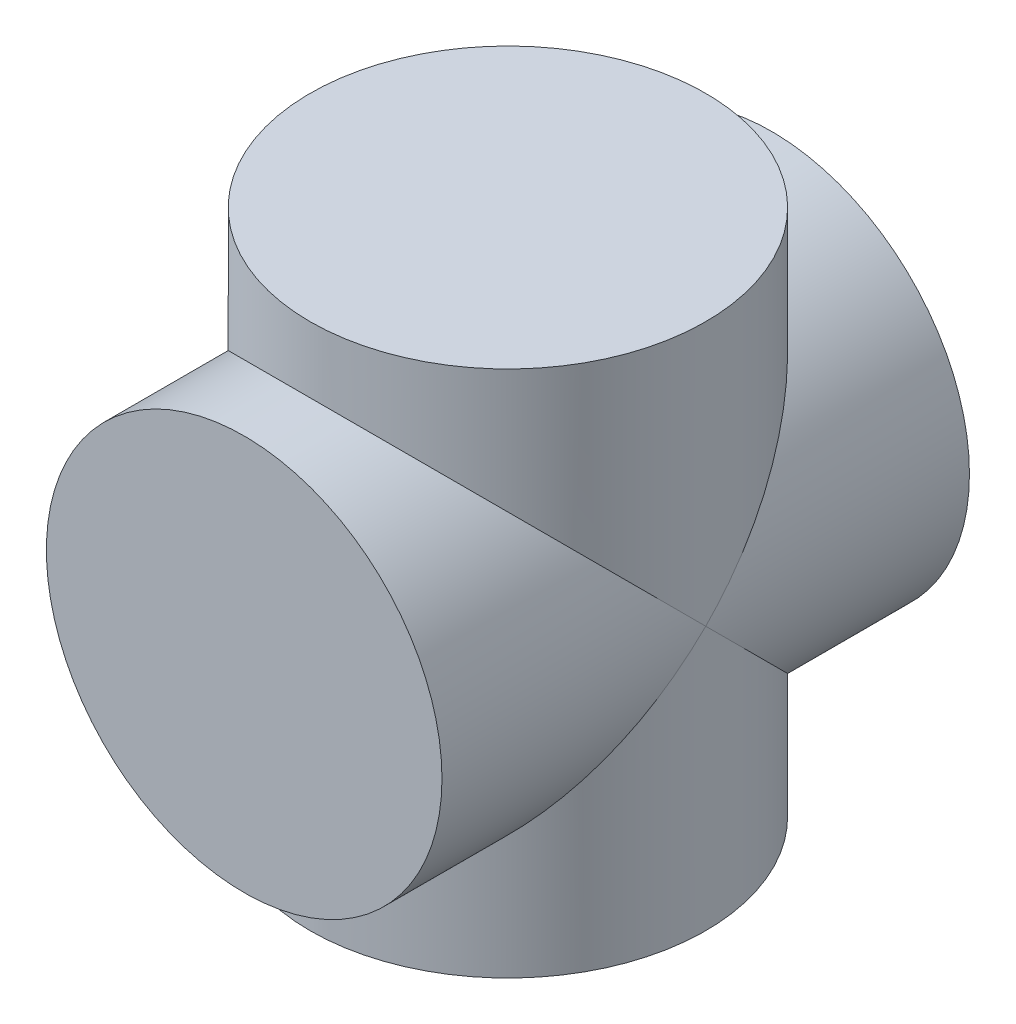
from build123d import *

# Parameters (mm, degrees)
SKETCH_1_R      = 15
EXTRUDE_1_DEPTH = 40


with BuildPart() as part:
    # Sketch 1 → Extrude 1 (new body)
    with BuildSketch(Plane.XY):
        Circle(SKETCH_1_R)
    extrude(amount=EXTRUDE_1_DEPTH)

    # Sketch 2 → Revolve 1 (revolve)
    with BuildSketch(Plane.XY.offset(20), mode=Mode.PRIVATE) as revolve_1_sk:
        Polygon((-15, 20), (-15, 0), (-15, -20), (0, -20), (0, 20), align=None)
    revolve(revolve_1_sk.sketch.rotate(Axis((0, 29.360453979, 20), (0, -1, 0)), 270), axis=Axis((0, 29.360453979, 20), (0, -1, 0)))


solid = part.part
